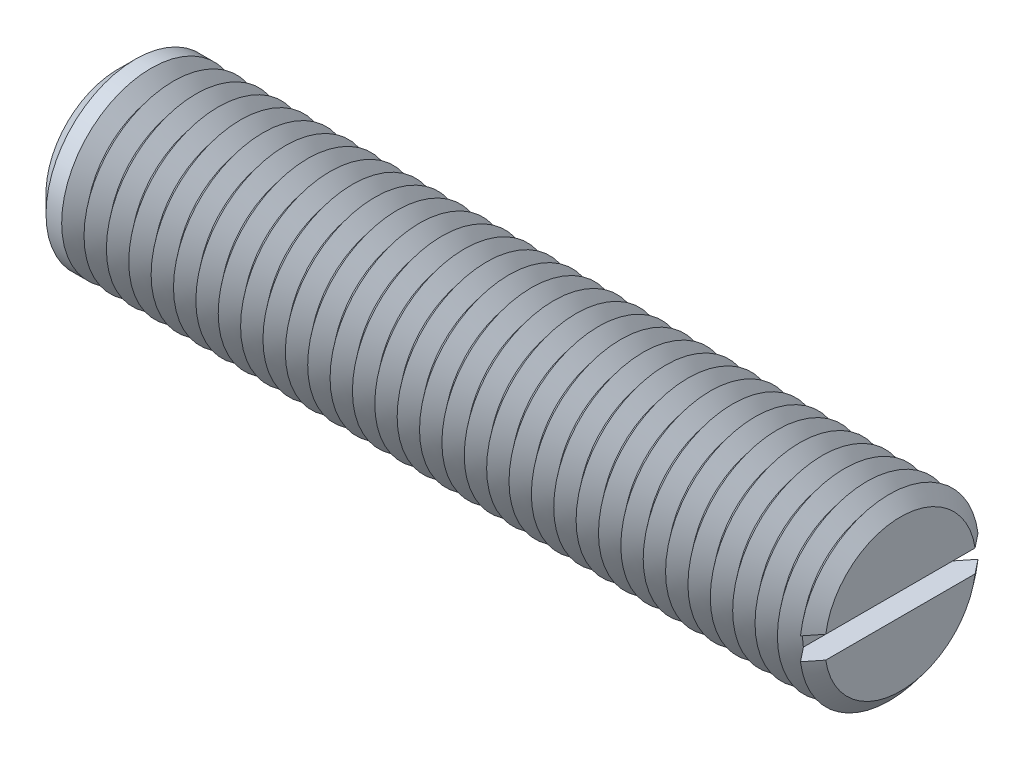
from build123d import *

# Parameters (mm, degrees)
SKETCH1_R       = 8
EXTRUDE1_DEPTH  = 35
SKETCH2_W       = 2
SKETCH2_H       = 2
EXTRUDE2_DEPTH  = 12
CHAMFER1_SIZE   = 1.6
LPATTERN1_COUNT = 34
LPATTERN1_PITCH = 2


with BuildPart() as part:
    # Sketch1 → Extrude1 (new, symmetric)
    with BuildSketch(Plane(origin=(0, 0, 0), x_dir=(0, 0, -1), z_dir=(1, 0, 0))):
        Circle(SKETCH1_R)
    extrude(amount=EXTRUDE1_DEPTH, both=True)

    # Sketch2 → Extrude2 (cut, symmetric)
    with BuildSketch(Plane.XY):
        with Locations((34, 0)):
            Rectangle(SKETCH2_W, SKETCH2_H)
    extrude(amount=EXTRUDE2_DEPTH, both=True, mode=Mode.SUBTRACT)

    # Chamfer1
    chamfer1_edges = [part.edges().sort_by_distance(p)[0] for p in [
        (-35, 0, 8),
    ]]
    chamfer(chamfer1_edges, length=CHAMFER1_SIZE)

    # Sketch3 → Cut-Revolve1 (revolve, cut)
    with BuildSketch(Plane.XY, mode=Mode.PRIVATE) as cut_revolve1_sk:
        Polygon((34, -8), (36, -8), (35, -6.7510004), align=None)
    cut_revolve1 = revolve(cut_revolve1_sk.sketch.rotate(Axis((0, 0, 0), (1, 0, 0)), 277.180755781), axis=Axis((0, 0, 0), (1, 0, 0)), mode=Mode.SUBTRACT)

    # LPattern1: Cut-Revolve1 ×34
    with Locations(*[(-i * LPATTERN1_PITCH, 0, 0) for i in range(1, LPATTERN1_COUNT)]):
        add(cut_revolve1, mode=Mode.SUBTRACT)


solid = part.part
